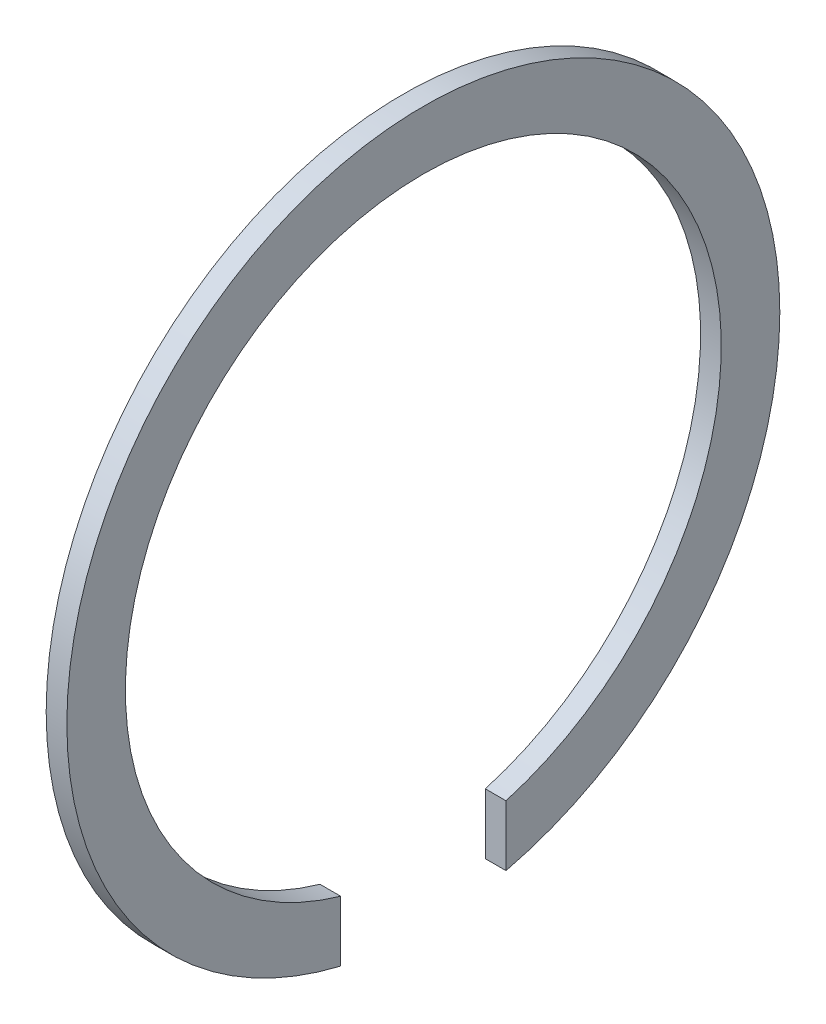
from build123d import *

# Parameters (mm, degrees)
ESQUISSE1_W             = 3
ESQUISSE1_H             = 8.5
ESQUISSE3_W             = 24
ESQUISSE3_H             = 413.570380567
ENL_V_MAT_EXTRU_1_DEPTH = 74.247013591


with BuildPart() as part:
    # Esquisse1 → R_volution1 (revolve)
    with BuildSketch(Plane.XY, mode=Mode.PRIVATE) as r_volution1_sk:
        with Locations((-1.5, 47.5)):
            Rectangle(ESQUISSE1_W, ESQUISSE1_H)
    revolve(r_volution1_sk.sketch.rotate(Axis((0, 0, 0), (-1, 0, 0)), 90), axis=Axis((0, 0, 0), (-1, 0, 0)))

    # Esquisse3 → Enl_v. mat.-Extru.1 (cut, through all)
    with BuildSketch(Plane(origin=(0, 0, 0), x_dir=(0, 0, -1), z_dir=(1, 0, 0))):
        with Locations((0, -207.095603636)):
            Rectangle(ESQUISSE3_W, ESQUISSE3_H)
    extrude(amount=-ENL_V_MAT_EXTRU_1_DEPTH, mode=Mode.SUBTRACT)


solid = part.part
